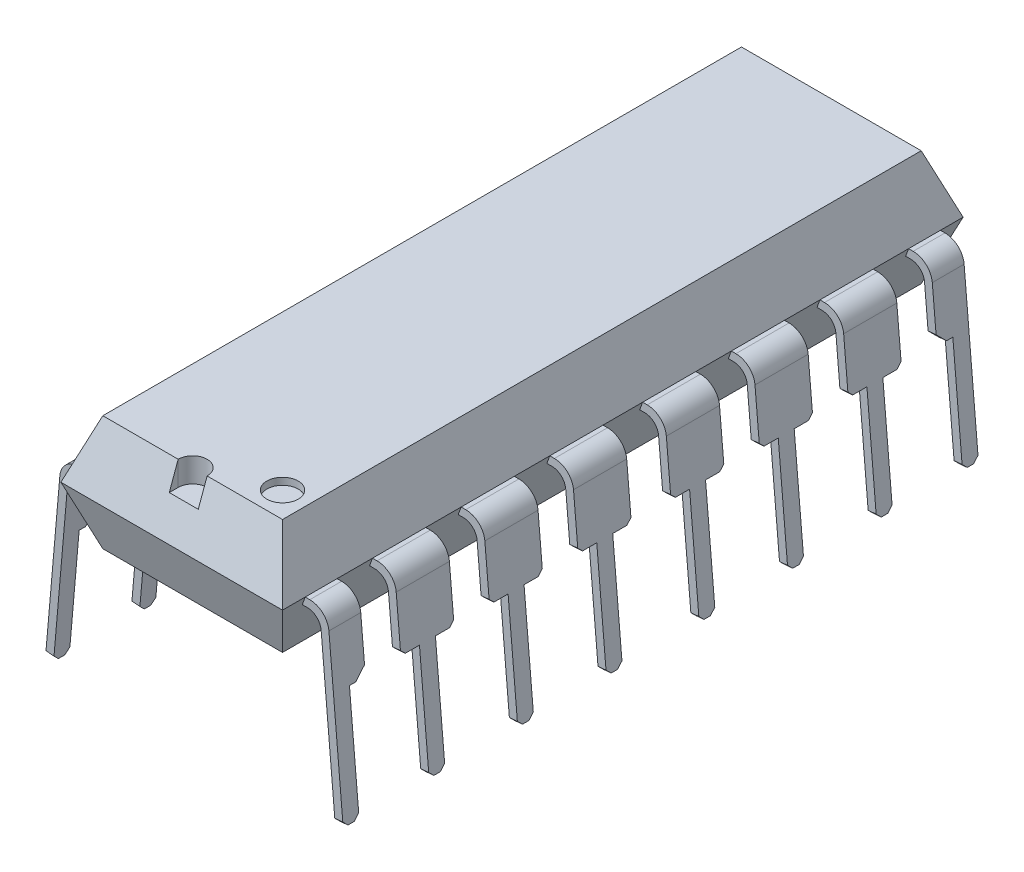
from build123d import *

# Parameters (mm, degrees)
BOSS_EXTRUDE1_DEPTH     = 19.5
CUT_EXTRUDE2_DEPTH      = 9.5
CUT_EXTRUDE2_DEPTH_BACK = 9.5
CUT_EXTRUDE3_DEPTH      = 0.7
SKETCH4_W               = 0.83
SKETCH4_H               = 0.7
CUT_EXTRUDE4_DEPTH      = 0.7
SKETCH9_R               = 0.45
CUT_EXTRUDE7_DEPTH      = 0.2
BOSS_EXTRUDE2_START     = -0.762
BOSS_EXTRUDE2_DEPTH     = 0.912
CUT_EXTRUDE5_DEPTH      = 10.15
BOSS_EXTRUDE3_DEPTH     = 0.762
CUT_EXTRUDE6_DEPTH      = 0.762
LPATTERN1_COUNT         = 3
LPATTERN1_PITCH         = 2.54
MIRROR1_COPY_1_DEPTH    = 0.762
MIRROR1_COPY_2_DEPTH    = 0.762
MIRROR1_COPY_3_DEPTH    = 0.762
MIRROR1_COPY_4_DEPTH    = 0.762
MIRROR2_COPY_1_DEPTH    = 0.762
MIRROR2_COPY_2_DEPTH    = 0.762
MIRROR2_COPY_3_DEPTH    = 0.762
MIRROR2_COPY_4_DEPTH    = 0.762
MIRROR2_START           = -0.762
MIRROR2_COPY_5_DEPTH    = 0.912
MIRROR2_COPY_6_DEPTH    = 10.15
MIRROR2_COPY_7_DEPTH    = 0.762
MIRROR2_COPY_8_DEPTH    = 0.762
MIRROR2_COPY_9_DEPTH    = 0.762
MIRROR2_COPY_10_DEPTH   = 0.762
MIRROR2_COPY_11_DEPTH   = 0.762
MIRROR2_COPY_12_DEPTH   = 0.762


with BuildPart() as part:
    # Sketch1 → Boss-Extrude1 (new body)
    with BuildSketch(Plane.XY):
        Polygon((-24.934327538, -0.557710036), (-25.534514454, 1.091289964), (-30.684140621, 1.091289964), (-31.284327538, -0.557710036), (-30.683412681, -2.208710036), (-25.535242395, -2.208710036), align=None)
    extrude(amount=-BOSS_EXTRUDE1_DEPTH)

    # Sketch2 → Cut-Extrude2 (cut, two sides: drawn at the far end of the back side and taken through both)
    with BuildSketch(Plane(origin=(-30.683898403, -0.0067685, 0), x_dir=(0, 0, 1), z_dir=(-0.9999999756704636, -0.00022058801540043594, 0)).offset(-CUT_EXTRUDE2_DEPTH_BACK)):
        Polygon((-0.616330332, -2.245563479), (0, -0.552209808), (0, -2.212209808), align=None)
        Polygon((-0.60064854, 1.098058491), (0, -0.552209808), (0, 1.098058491), align=None)
        Polygon((-19.5, -2.212209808), (-17.722469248, -5.435935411), (-19.5, -0.552209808), align=None)
        Polygon((-19.5, -0.552209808), (-19.5, 1.098058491), (-18.89935146, 1.098058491), align=None)
    extrude(amount=CUT_EXTRUDE2_DEPTH + CUT_EXTRUDE2_DEPTH_BACK, mode=Mode.SUBTRACT)

    # Sketch3 → Cut-Extrude3 (cut)
    with BuildSketch(Plane(origin=(0, 1.091289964, 0), x_dir=(1, 0, 0), z_dir=(0, 1, 0))):
        with BuildLine():
            Line((-28.524327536, 0.600475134), (-27.694327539, 0.600408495))
            ThreePointArc((-27.694327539, 0.600408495), (-28.109294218, 1.015441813), (-28.524327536, 0.600475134))
        make_face()
    extrude(amount=-CUT_EXTRUDE3_DEPTH, mode=Mode.SUBTRACT)

    # Sketch4 → Cut-Extrude4 (cut)
    with BuildSketch(Plane(origin=(4.8027e-05, 0, -0.598184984), x_dir=(-0.9999999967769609, 0, -8.028747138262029e-05), z_dir=(8.028747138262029e-05, 0, -0.9999999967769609))):
        with Locations((28.109375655, 0.741289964)):
            Rectangle(SKETCH4_W, SKETCH4_H)
    extrude(amount=-CUT_EXTRUDE4_DEPTH, mode=Mode.SUBTRACT)

    # Sketch9 → Cut-Extrude7 (cut)
    with BuildSketch(Plane(origin=(0, 1.091289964, 0), x_dir=(1, 0, 0), z_dir=(0, 1, 0))):
        with Locations(Location((-26.264514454, 1.330293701, 0), (0, 0, 180))):
            Circle(SKETCH9_R)
    extrude(amount=-CUT_EXTRUDE7_DEPTH, mode=Mode.SUBTRACT)


with BuildPart() as boss_extrude2_tool:
    # Sketch5 → Boss-Extrude2 (new body)
    with BuildSketch(Plane.XY.offset(-0.8).offset(BOSS_EXTRUDE2_START)):
        with BuildLine():
            Line((-24.934327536, -0.557714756), (-24.80305479, -0.557714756))
            ThreePointArc((-24.80305479, -0.557714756), (-24.431480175, -0.702212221), (-24.255147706, -1.059779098))
            Line((-24.255147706, -1.059779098), (-23.8457983, -5.738664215))
            Line((-23.8457983, -5.738664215), (-24.074923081, -5.758710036))
            Line((-24.074923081, -5.758710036), (-24.477883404, -1.152852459))
            ThreePointArc((-24.477883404, -1.152852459), (-24.606125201, -0.892803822), (-24.876361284, -0.787714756))
            Line((-24.876361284, -0.787714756), (-25.018040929, -0.787714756))
            Line((-25.018040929, -0.787714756), (-24.934327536, -0.557714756))
        make_face()
    boss_extrude2 = extrude(amount=BOSS_EXTRUDE2_DEPTH)


with BuildPart() as part_1:
    add(part.part)


with BuildPart() as part_2:
    # Boss-Extrude2: joined with boss_extrude2_tool
    add(part_1.part.fuse(boss_extrude2_tool.part, tol=0.00001))

    # Sketch6 → Cut-Extrude5 (cut)
    with BuildSketch(Plane(origin=(-24.162916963, -2.113981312, 0), x_dir=(0, 0, -1), z_dir=(0.9961946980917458, 0.08715574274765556, 0))):
        Polygon((0.65, -3.502234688), (0.65, -3.638528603), (0.786293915, -3.638528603), align=None)
        Polygon((1.106, -3.502234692), (0.96970609, -3.638528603), (1.106, -3.638528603), align=None)
        Polygon((1.106, -3.502234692), (1.106, -3.638528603), (1.562, -3.638528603), (1.562, -0.186528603), (1.285, -0.463528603), (1.106, -0.463528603), align=None)
    cut_extrude5 = extrude(amount=-CUT_EXTRUDE5_DEPTH, mode=Mode.SUBTRACT)

    # Sketch7 → Boss-Extrude3 (add, symmetric)
    with BuildSketch(Plane.XY.offset(-3.34)):
        with BuildLine():
            Line((-24.934327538, -0.557710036), (-24.803054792, -0.557710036))
            ThreePointArc((-24.803054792, -0.557710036), (-24.431480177, -0.7022075), (-24.255147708, -1.059774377))
            Line((-24.255147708, -1.059774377), (-23.845798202, -5.738660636))
            Line((-23.845798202, -5.738660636), (-24.074922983, -5.758706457))
            Line((-24.074922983, -5.758706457), (-24.477883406, -1.152847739))
            ThreePointArc((-24.477883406, -1.152847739), (-24.606125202, -0.892799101), (-24.876361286, -0.787710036))
            Line((-24.876361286, -0.787710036), (-25.018040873, -0.787710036))
            Line((-25.018040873, -0.787710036), (-24.934327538, -0.557710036))
        make_face()
    boss_extrude3 = extrude(amount=BOSS_EXTRUDE3_DEPTH, both=True)

    # Sketch8 → Cut-Extrude6 (cut)
    with BuildSketch(Plane(origin=(-24.162916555, -2.113981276, 0), x_dir=(0, 0, -1), z_dir=(0.9961946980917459, 0.08715574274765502, 0))):
        Polygon((2.578, -3.638525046), (3.1115, -3.638525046), (3.1115, -3.502234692), (3.1115, -0.463528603), (2.705, -0.463528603), (2.578, -0.336528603), align=None)
        Polygon((3.5685, -0.463528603), (3.5685, -3.502234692), (3.5685, -3.638525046), (4.102, -3.638525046), (4.102, -0.336528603), (3.975, -0.463528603), align=None)
        Polygon((3.1115, -3.502234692), (3.1115, -3.638525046), (3.247790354, -3.638525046), align=None)
        Polygon((3.5685, -3.502234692), (3.432209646, -3.638525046), (3.5685, -3.638525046), align=None)
    cut_extrude6 = extrude(amount=-CUT_EXTRUDE6_DEPTH, mode=Mode.SUBTRACT)

    # LPattern1: Boss-Extrude3, Cut-Extrude6 ×3
    with Locations(*[(0, 0, -i * LPATTERN1_PITCH) for i in range(1, LPATTERN1_COUNT)]):
        add(boss_extrude3)
        add(cut_extrude6, mode=Mode.SUBTRACT)

    # Mirror1: Boss-Extrude2, Cut-Extrude5, Boss-Extrude3, Cut-Extrude6 across plane
    add(boss_extrude2.mirror(Plane.XY.offset(-9.75)))
    add(cut_extrude5.mirror(Plane.XY.offset(-9.75)), mode=Mode.SUBTRACT)
    add(boss_extrude3.mirror(Plane.XY.offset(-9.75)))
    add(cut_extrude6.mirror(Plane.XY.offset(-9.75)), mode=Mode.SUBTRACT)

    # Mirror1 copy 1 sketch → Mirror1 copy 1 (add, symmetric)
    with BuildSketch(Plane(origin=(0, 0, -13.62), x_dir=(1, 0, 0), z_dir=(0, 0, -1))):
        with BuildLine():
            Line((-24.934327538, 0.557710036), (-24.803054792, 0.557710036))
            ThreePointArc((-24.803054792, 0.557710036), (-24.431480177, 0.7022075), (-24.255147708, 1.059774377))
            Line((-24.255147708, 1.059774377), (-23.845798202, 5.738660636))
            Line((-23.845798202, 5.738660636), (-24.074922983, 5.758706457))
            Line((-24.074922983, 5.758706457), (-24.477883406, 1.152847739))
            ThreePointArc((-24.477883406, 1.152847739), (-24.606125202, 0.892799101), (-24.876361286, 0.787710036))
            Line((-24.876361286, 0.787710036), (-25.018040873, 0.787710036))
            Line((-25.018040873, 0.787710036), (-24.934327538, 0.557710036))
        make_face()
    extrude(amount=MIRROR1_COPY_1_DEPTH, both=True)

    # Mirror1 copy 2 sketch → Mirror1 copy 2 (add, symmetric)
    with BuildSketch(Plane(origin=(0, 0, -11.08), x_dir=(1, 0, 0), z_dir=(0, 0, -1))):
        with BuildLine():
            Line((-24.934327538, 0.557710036), (-24.803054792, 0.557710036))
            ThreePointArc((-24.803054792, 0.557710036), (-24.431480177, 0.7022075), (-24.255147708, 1.059774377))
            Line((-24.255147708, 1.059774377), (-23.845798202, 5.738660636))
            Line((-23.845798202, 5.738660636), (-24.074922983, 5.758706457))
            Line((-24.074922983, 5.758706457), (-24.477883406, 1.152847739))
            ThreePointArc((-24.477883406, 1.152847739), (-24.606125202, 0.892799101), (-24.876361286, 0.787710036))
            Line((-24.876361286, 0.787710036), (-25.018040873, 0.787710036))
            Line((-25.018040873, 0.787710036), (-24.934327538, 0.557710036))
        make_face()
    extrude(amount=MIRROR1_COPY_2_DEPTH, both=True)

    # Mirror1 copy 3 sketch → Mirror1 copy 3 (cut)
    with BuildSketch(Plane(origin=(-24.162916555, -2.113981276, -16.96), x_dir=(0, 0, 1), z_dir=(0.9961946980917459, 0.08715574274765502, 0))):
        Polygon((2.578, 3.638525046), (3.1115, 3.638525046), (3.1115, 3.502234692), (3.1115, 0.463528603), (2.705, 0.463528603), (2.578, 0.336528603), align=None)
        Polygon((3.5685, 0.463528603), (3.5685, 3.502234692), (3.5685, 3.638525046), (4.102, 3.638525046), (4.102, 0.336528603), (3.975, 0.463528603), align=None)
        Polygon((3.1115, 3.502234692), (3.1115, 3.638525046), (3.247790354, 3.638525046), align=None)
        Polygon((3.5685, 3.502234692), (3.432209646, 3.638525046), (3.5685, 3.638525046), align=None)
    extrude(amount=-MIRROR1_COPY_3_DEPTH, mode=Mode.SUBTRACT)

    # Mirror1 copy 4 sketch → Mirror1 copy 4 (cut)
    with BuildSketch(Plane(origin=(-24.162916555, -2.113981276, -14.42), x_dir=(0, 0, 1), z_dir=(0.9961946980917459, 0.08715574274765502, 0))):
        Polygon((2.578, 3.638525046), (3.1115, 3.638525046), (3.1115, 3.502234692), (3.1115, 0.463528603), (2.705, 0.463528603), (2.578, 0.336528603), align=None)
        Polygon((3.5685, 0.463528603), (3.5685, 3.502234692), (3.5685, 3.638525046), (4.102, 3.638525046), (4.102, 0.336528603), (3.975, 0.463528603), align=None)
        Polygon((3.1115, 3.502234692), (3.1115, 3.638525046), (3.247790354, 3.638525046), align=None)
        Polygon((3.5685, 3.502234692), (3.432209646, 3.638525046), (3.5685, 3.638525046), align=None)
    extrude(amount=-MIRROR1_COPY_4_DEPTH, mode=Mode.SUBTRACT)

    # Mirror2: Boss-Extrude2, Cut-Extrude5, Boss-Extrude3, Cut-Extrude6 across plane
    add(boss_extrude2.mirror(Plane(origin=(-28.109327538, 0, 0), x_dir=(0, 0, 1), z_dir=(1, 0, 0))))
    add(cut_extrude5.mirror(Plane(origin=(-28.109327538, 0, 0), x_dir=(0, 0, 1), z_dir=(1, 0, 0))), mode=Mode.SUBTRACT)
    add(boss_extrude3.mirror(Plane(origin=(-28.109327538, 0, 0), x_dir=(0, 0, 1), z_dir=(1, 0, 0))))
    add(cut_extrude6.mirror(Plane(origin=(-28.109327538, 0, 0), x_dir=(0, 0, 1), z_dir=(1, 0, 0))), mode=Mode.SUBTRACT)

    # Mirror2 copy 1 sketch → Mirror2 copy 1 (add, symmetric)
    with BuildSketch(Plane(origin=(-56.218655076, 0, -5.88), x_dir=(-1, 0, 0), z_dir=(0, 0, 1))):
        with BuildLine():
            Line((-24.934327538, 0.557710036), (-24.803054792, 0.557710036))
            ThreePointArc((-24.803054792, 0.557710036), (-24.431480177, 0.7022075), (-24.255147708, 1.059774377))
            Line((-24.255147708, 1.059774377), (-23.845798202, 5.738660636))
            Line((-23.845798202, 5.738660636), (-24.074922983, 5.758706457))
            Line((-24.074922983, 5.758706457), (-24.477883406, 1.152847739))
            ThreePointArc((-24.477883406, 1.152847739), (-24.606125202, 0.892799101), (-24.876361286, 0.787710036))
            Line((-24.876361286, 0.787710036), (-25.018040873, 0.787710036))
            Line((-25.018040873, 0.787710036), (-24.934327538, 0.557710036))
        make_face()
    extrude(amount=MIRROR2_COPY_1_DEPTH, both=True)

    # Mirror2 copy 2 sketch → Mirror2 copy 2 (add, symmetric)
    with BuildSketch(Plane(origin=(-56.218655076, 0, -8.42), x_dir=(-1, 0, 0), z_dir=(0, 0, 1))):
        with BuildLine():
            Line((-24.934327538, 0.557710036), (-24.803054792, 0.557710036))
            ThreePointArc((-24.803054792, 0.557710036), (-24.431480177, 0.7022075), (-24.255147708, 1.059774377))
            Line((-24.255147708, 1.059774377), (-23.845798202, 5.738660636))
            Line((-23.845798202, 5.738660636), (-24.074922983, 5.758706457))
            Line((-24.074922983, 5.758706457), (-24.477883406, 1.152847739))
            ThreePointArc((-24.477883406, 1.152847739), (-24.606125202, 0.892799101), (-24.876361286, 0.787710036))
            Line((-24.876361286, 0.787710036), (-25.018040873, 0.787710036))
            Line((-25.018040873, 0.787710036), (-24.934327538, 0.557710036))
        make_face()
    extrude(amount=MIRROR2_COPY_2_DEPTH, both=True)

    # Mirror2 copy 3 sketch → Mirror2 copy 3 (cut)
    with BuildSketch(Plane(origin=(-32.055738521, -2.113981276, -2.54), x_dir=(0, 0, -1), z_dir=(-0.9961946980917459, 0.08715574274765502, 0))):
        Polygon((2.578, 3.638525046), (3.1115, 3.638525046), (3.1115, 3.502234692), (3.1115, 0.463528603), (2.705, 0.463528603), (2.578, 0.336528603), align=None)
        Polygon((3.5685, 0.463528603), (3.5685, 3.502234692), (3.5685, 3.638525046), (4.102, 3.638525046), (4.102, 0.336528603), (3.975, 0.463528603), align=None)
        Polygon((3.1115, 3.502234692), (3.1115, 3.638525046), (3.247790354, 3.638525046), align=None)
        Polygon((3.5685, 3.502234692), (3.432209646, 3.638525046), (3.5685, 3.638525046), align=None)
    extrude(amount=-MIRROR2_COPY_3_DEPTH, mode=Mode.SUBTRACT)

    # Mirror2 copy 4 sketch → Mirror2 copy 4 (cut)
    with BuildSketch(Plane(origin=(-32.055738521, -2.113981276, -5.08), x_dir=(0, 0, -1), z_dir=(-0.9961946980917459, 0.08715574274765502, 0))):
        Polygon((2.578, 3.638525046), (3.1115, 3.638525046), (3.1115, 3.502234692), (3.1115, 0.463528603), (2.705, 0.463528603), (2.578, 0.336528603), align=None)
        Polygon((3.5685, 0.463528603), (3.5685, 3.502234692), (3.5685, 3.638525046), (4.102, 3.638525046), (4.102, 0.336528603), (3.975, 0.463528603), align=None)
        Polygon((3.1115, 3.502234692), (3.1115, 3.638525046), (3.247790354, 3.638525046), align=None)
        Polygon((3.5685, 3.502234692), (3.432209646, 3.638525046), (3.5685, 3.638525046), align=None)
    extrude(amount=-MIRROR2_COPY_4_DEPTH, mode=Mode.SUBTRACT)


with BuildPart() as mirror2_copy_5_tool:
    # Mirror2 copy 5 sketch → Mirror2 copy 5 (new body)
    with BuildSketch(Plane(origin=(-56.218655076, 0, -18.7), x_dir=(-1, 0, 0), z_dir=(0, 0, -1)).offset(MIRROR2_START)):
        with BuildLine():
            Line((-24.934327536, -0.557714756), (-24.80305479, -0.557714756))
            ThreePointArc((-24.80305479, -0.557714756), (-24.431480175, -0.702212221), (-24.255147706, -1.059779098))
            Line((-24.255147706, -1.059779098), (-23.8457983, -5.738664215))
            Line((-23.8457983, -5.738664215), (-24.074923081, -5.758710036))
            Line((-24.074923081, -5.758710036), (-24.477883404, -1.152852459))
            ThreePointArc((-24.477883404, -1.152852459), (-24.606125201, -0.892803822), (-24.876361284, -0.787714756))
            Line((-24.876361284, -0.787714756), (-25.018040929, -0.787714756))
            Line((-25.018040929, -0.787714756), (-24.934327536, -0.557714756))
        make_face()
    extrude(amount=MIRROR2_COPY_5_DEPTH)


with BuildPart() as part_3:
    add(part_2.part)


with BuildPart() as part_4:
    # Mirror2 copy 5: joined with mirror2_copy_5_tool
    add(part_3.part.fuse(mirror2_copy_5_tool.part, tol=0.00001))

    # Mirror2 copy 6 sketch → Mirror2 copy 6 (cut)
    with BuildSketch(Plane(origin=(-32.055738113, -2.113981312, -19.5), x_dir=(0, 0, 1), z_dir=(-0.9961946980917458, 0.08715574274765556, 0))):
        Polygon((0.65, -3.502234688), (0.65, -3.638528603), (0.786293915, -3.638528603), align=None)
        Polygon((1.106, -3.502234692), (0.96970609, -3.638528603), (1.106, -3.638528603), align=None)
        Polygon((1.106, -3.502234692), (1.106, -3.638528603), (1.562, -3.638528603), (1.562, -0.186528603), (1.285, -0.463528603), (1.106, -0.463528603), align=None)
    extrude(amount=-MIRROR2_COPY_6_DEPTH, mode=Mode.SUBTRACT)

    # Mirror2 copy 7 sketch → Mirror2 copy 7 (add, symmetric)
    with BuildSketch(Plane(origin=(-56.218655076, 0, -16.16), x_dir=(-1, 0, 0), z_dir=(0, 0, -1))):
        with BuildLine():
            Line((-24.934327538, -0.557710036), (-24.803054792, -0.557710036))
            ThreePointArc((-24.803054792, -0.557710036), (-24.431480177, -0.7022075), (-24.255147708, -1.059774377))
            Line((-24.255147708, -1.059774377), (-23.845798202, -5.738660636))
            Line((-23.845798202, -5.738660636), (-24.074922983, -5.758706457))
            Line((-24.074922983, -5.758706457), (-24.477883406, -1.152847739))
            ThreePointArc((-24.477883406, -1.152847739), (-24.606125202, -0.892799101), (-24.876361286, -0.787710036))
            Line((-24.876361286, -0.787710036), (-25.018040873, -0.787710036))
            Line((-25.018040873, -0.787710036), (-24.934327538, -0.557710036))
        make_face()
    extrude(amount=MIRROR2_COPY_7_DEPTH, both=True)

    # Mirror2 copy 8 sketch → Mirror2 copy 8 (cut)
    with BuildSketch(Plane(origin=(-32.055738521, -2.113981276, -19.5), x_dir=(0, 0, 1), z_dir=(-0.9961946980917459, 0.08715574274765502, 0))):
        Polygon((2.578, -3.638525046), (3.1115, -3.638525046), (3.1115, -3.502234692), (3.1115, -0.463528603), (2.705, -0.463528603), (2.578, -0.336528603), align=None)
        Polygon((3.5685, -0.463528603), (3.5685, -3.502234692), (3.5685, -3.638525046), (4.102, -3.638525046), (4.102, -0.336528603), (3.975, -0.463528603), align=None)
        Polygon((3.1115, -3.502234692), (3.1115, -3.638525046), (3.247790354, -3.638525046), align=None)
        Polygon((3.5685, -3.502234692), (3.432209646, -3.638525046), (3.5685, -3.638525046), align=None)
    extrude(amount=-MIRROR2_COPY_8_DEPTH, mode=Mode.SUBTRACT)

    # Mirror2 copy 9 sketch → Mirror2 copy 9 (add, symmetric)
    with BuildSketch(Plane(origin=(-56.218655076, 0, -13.62), x_dir=(-1, 0, 0), z_dir=(0, 0, -1))):
        with BuildLine():
            Line((-24.934327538, -0.557710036), (-24.803054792, -0.557710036))
            ThreePointArc((-24.803054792, -0.557710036), (-24.431480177, -0.7022075), (-24.255147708, -1.059774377))
            Line((-24.255147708, -1.059774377), (-23.845798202, -5.738660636))
            Line((-23.845798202, -5.738660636), (-24.074922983, -5.758706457))
            Line((-24.074922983, -5.758706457), (-24.477883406, -1.152847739))
            ThreePointArc((-24.477883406, -1.152847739), (-24.606125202, -0.892799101), (-24.876361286, -0.787710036))
            Line((-24.876361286, -0.787710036), (-25.018040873, -0.787710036))
            Line((-25.018040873, -0.787710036), (-24.934327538, -0.557710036))
        make_face()
    extrude(amount=MIRROR2_COPY_9_DEPTH, both=True)

    # Mirror2 copy 10 sketch → Mirror2 copy 10 (add, symmetric)
    with BuildSketch(Plane(origin=(-56.218655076, 0, -11.08), x_dir=(-1, 0, 0), z_dir=(0, 0, -1))):
        with BuildLine():
            Line((-24.934327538, -0.557710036), (-24.803054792, -0.557710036))
            ThreePointArc((-24.803054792, -0.557710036), (-24.431480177, -0.7022075), (-24.255147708, -1.059774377))
            Line((-24.255147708, -1.059774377), (-23.845798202, -5.738660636))
            Line((-23.845798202, -5.738660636), (-24.074922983, -5.758706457))
            Line((-24.074922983, -5.758706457), (-24.477883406, -1.152847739))
            ThreePointArc((-24.477883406, -1.152847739), (-24.606125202, -0.892799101), (-24.876361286, -0.787710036))
            Line((-24.876361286, -0.787710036), (-25.018040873, -0.787710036))
            Line((-25.018040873, -0.787710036), (-24.934327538, -0.557710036))
        make_face()
    extrude(amount=MIRROR2_COPY_10_DEPTH, both=True)

    # Mirror2 copy 11 sketch → Mirror2 copy 11 (cut)
    with BuildSketch(Plane(origin=(-32.055738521, -2.113981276, -16.96), x_dir=(0, 0, 1), z_dir=(-0.9961946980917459, 0.08715574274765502, 0))):
        Polygon((2.578, -3.638525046), (3.1115, -3.638525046), (3.1115, -3.502234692), (3.1115, -0.463528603), (2.705, -0.463528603), (2.578, -0.336528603), align=None)
        Polygon((3.5685, -0.463528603), (3.5685, -3.502234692), (3.5685, -3.638525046), (4.102, -3.638525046), (4.102, -0.336528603), (3.975, -0.463528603), align=None)
        Polygon((3.1115, -3.502234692), (3.1115, -3.638525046), (3.247790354, -3.638525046), align=None)
        Polygon((3.5685, -3.502234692), (3.432209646, -3.638525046), (3.5685, -3.638525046), align=None)
    extrude(amount=-MIRROR2_COPY_11_DEPTH, mode=Mode.SUBTRACT)

    # Mirror2 copy 12 sketch → Mirror2 copy 12 (cut)
    with BuildSketch(Plane(origin=(-32.055738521, -2.113981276, -14.42), x_dir=(0, 0, 1), z_dir=(-0.9961946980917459, 0.08715574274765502, 0))):
        Polygon((2.578, -3.638525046), (3.1115, -3.638525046), (3.1115, -3.502234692), (3.1115, -0.463528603), (2.705, -0.463528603), (2.578, -0.336528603), align=None)
        Polygon((3.5685, -0.463528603), (3.5685, -3.502234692), (3.5685, -3.638525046), (4.102, -3.638525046), (4.102, -0.336528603), (3.975, -0.463528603), align=None)
        Polygon((3.1115, -3.502234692), (3.1115, -3.638525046), (3.247790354, -3.638525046), align=None)
        Polygon((3.5685, -3.502234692), (3.432209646, -3.638525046), (3.5685, -3.638525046), align=None)
    extrude(amount=-MIRROR2_COPY_12_DEPTH, mode=Mode.SUBTRACT)


solid = part_4.part
